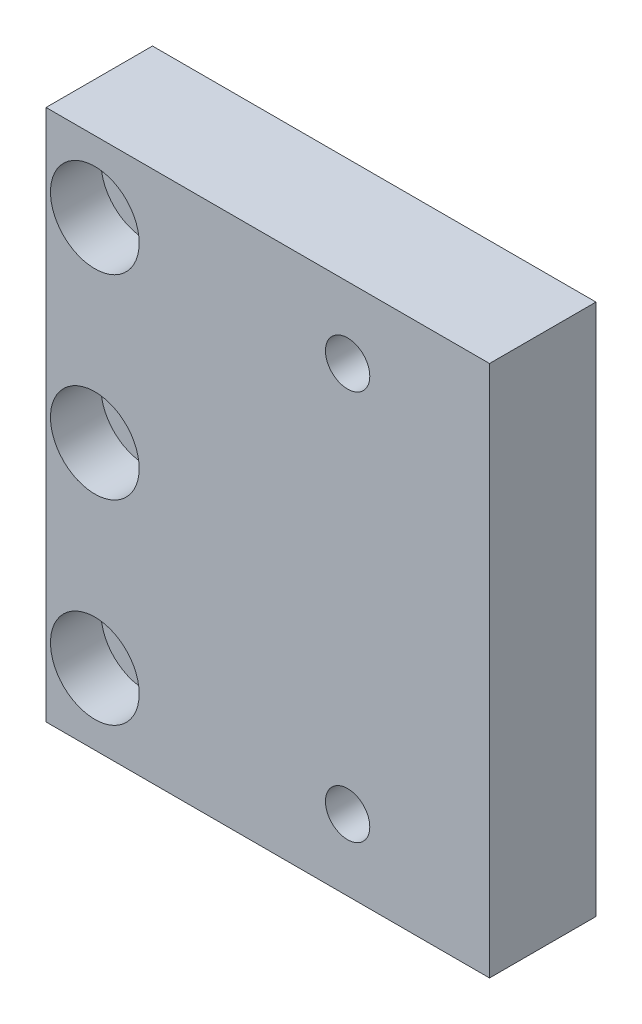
ISO-10303-21;
HEADER;
FILE_DESCRIPTION(('STEP AP214'),'2;1');
FILE_NAME('part.step','',(''),(''),'','','');
FILE_SCHEMA(('AUTOMOTIVE_DESIGN { 1 0 10303 214 1 1 1 1 }'));
ENDSEC;
DATA;
#1=APPLICATION_CONTEXT('core data for automotive mechanical design processes');
#2=APPLICATION_PROTOCOL_DEFINITION('international standard','automotive_design',2000,#1);
#3=PRODUCT_CONTEXT('',#1,'mechanical');
#4=PRODUCT('Part','Part','',(#3));
#5=PRODUCT_RELATED_PRODUCT_CATEGORY('part','',(#4));
#6=PRODUCT_DEFINITION_FORMATION('','',#4);
#7=PRODUCT_DEFINITION_CONTEXT('part definition',#1,'design');
#8=PRODUCT_DEFINITION('design','',#6,#7);
#9=PRODUCT_DEFINITION_SHAPE('','',#8);
#10=(LENGTH_UNIT() NAMED_UNIT(*) SI_UNIT(.MILLI.,.METRE.));
#11=(NAMED_UNIT(*) PLANE_ANGLE_UNIT() SI_UNIT($,.RADIAN.));
#12=(NAMED_UNIT(*) SI_UNIT($,.STERADIAN.) SOLID_ANGLE_UNIT());
#13=UNCERTAINTY_MEASURE_WITH_UNIT(LENGTH_MEASURE(1.E-05),#10,'distance_accuracy_value','');
#14=(GEOMETRIC_REPRESENTATION_CONTEXT(3) GLOBAL_UNCERTAINTY_ASSIGNED_CONTEXT((#13)) GLOBAL_UNIT_ASSIGNED_CONTEXT((#10,
#11,#12)) REPRESENTATION_CONTEXT('',''));
#15=CARTESIAN_POINT('',(0.,0.,0.));
#16=DIRECTION('',(0.,0.,1.));
#17=DIRECTION('',(1.,0.,0.));
#18=AXIS2_PLACEMENT_3D('',#15,#16,#17);
#19=CARTESIAN_POINT('',(1.99999999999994,272.625283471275,12.));
#20=DIRECTION('',(1.,0.,0.));
#21=DIRECTION('',(0.,0.,-1.));
#22=AXIS2_PLACEMENT_3D('',#19,#20,#21);
#23=PLANE('',#22);
#24=DIRECTION('',(0.,-1.,0.));
#25=VECTOR('',#24,1.);
#26=CARTESIAN_POINT('',(1.99999999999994,272.625283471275,0.));
#27=LINE('',#26,#25);
#28=CARTESIAN_POINT('',(1.99999999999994,332.625283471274,0.));
#29=VERTEX_POINT('',#28);
#30=CARTESIAN_POINT('',(1.99999999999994,272.625283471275,0.));
#31=VERTEX_POINT('',#30);
#32=EDGE_CURVE('E79',#29,#31,#27,.T.);
#33=ORIENTED_EDGE('',*,*,#32,.T.);
#34=DIRECTION('',(0.,0.,-1.));
#35=VECTOR('',#34,1.);
#36=CARTESIAN_POINT('',(1.99999999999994,272.625283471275,12.));
#37=LINE('',#36,#35);
#38=CARTESIAN_POINT('',(1.99999999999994,272.625283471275,12.));
#39=VERTEX_POINT('',#38);
#40=EDGE_CURVE('E11',#39,#31,#37,.T.);
#41=ORIENTED_EDGE('',*,*,#40,.F.);
#42=DIRECTION('',(0.,-1.,0.));
#43=VECTOR('',#42,1.);
#44=CARTESIAN_POINT('',(1.99999999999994,272.625283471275,12.));
#45=LINE('',#44,#43);
#46=CARTESIAN_POINT('',(1.99999999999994,332.625283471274,12.));
#47=VERTEX_POINT('',#46);
#48=EDGE_CURVE('E67',#47,#39,#45,.T.);
#49=ORIENTED_EDGE('',*,*,#48,.F.);
#50=DIRECTION('',(0.,0.,-1.));
#51=VECTOR('',#50,1.);
#52=CARTESIAN_POINT('',(1.99999999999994,332.625283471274,12.));
#53=LINE('',#52,#51);
#54=EDGE_CURVE('E75',#47,#29,#53,.T.);
#55=ORIENTED_EDGE('',*,*,#54,.T.);
#56=EDGE_LOOP('',(#33,#41,#49,#55));
#57=FACE_BOUND('',#56,.T.);
#58=ADVANCED_FACE('F16',(#57),#23,.F.);
#59=CARTESIAN_POINT('',(1.99999999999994,272.625283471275,12.));
#60=DIRECTION('',(0.,1.,0.));
#61=DIRECTION('',(0.,0.,1.));
#62=AXIS2_PLACEMENT_3D('',#59,#60,#61);
#63=PLANE('',#62);
#64=DIRECTION('',(1.,0.,0.));
#65=VECTOR('',#64,1.);
#66=CARTESIAN_POINT('',(1.99999999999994,272.625283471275,0.));
#67=LINE('',#66,#65);
#68=CARTESIAN_POINT('',(52.,272.625283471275,0.));
#69=VERTEX_POINT('',#68);
#70=EDGE_CURVE('E71',#31,#69,#67,.T.);
#71=ORIENTED_EDGE('',*,*,#70,.T.);
#72=DIRECTION('',(0.,0.,-1.));
#73=VECTOR('',#72,1.);
#74=CARTESIAN_POINT('',(52.,272.625283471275,12.));
#75=LINE('',#74,#73);
#76=CARTESIAN_POINT('',(52.,272.625283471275,12.));
#77=VERTEX_POINT('',#76);
#78=EDGE_CURVE('E24',#77,#69,#75,.T.);
#79=ORIENTED_EDGE('',*,*,#78,.F.);
#80=DIRECTION('',(1.,0.,0.));
#81=VECTOR('',#80,1.);
#82=CARTESIAN_POINT('',(1.99999999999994,272.625283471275,12.));
#83=LINE('',#82,#81);
#84=EDGE_CURVE('E62',#39,#77,#83,.T.);
#85=ORIENTED_EDGE('',*,*,#84,.F.);
#86=ORIENTED_EDGE('',*,*,#40,.T.);
#87=EDGE_LOOP('',(#71,#79,#85,#86));
#88=FACE_BOUND('',#87,.T.);
#89=ADVANCED_FACE('F70',(#88),#63,.F.);
#90=CARTESIAN_POINT('',(52.,272.625283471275,12.));
#91=DIRECTION('',(-1.,0.,0.));
#92=DIRECTION('',(0.,0.,1.));
#93=AXIS2_PLACEMENT_3D('',#90,#91,#92);
#94=PLANE('',#93);
#95=DIRECTION('',(0.,1.,0.));
#96=VECTOR('',#95,1.);
#97=CARTESIAN_POINT('',(52.,272.625283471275,0.));
#98=LINE('',#97,#96);
#99=CARTESIAN_POINT('',(52.,332.625283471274,0.));
#100=VERTEX_POINT('',#99);
#101=EDGE_CURVE('E49',#69,#100,#98,.T.);
#102=ORIENTED_EDGE('',*,*,#101,.T.);
#103=DIRECTION('',(0.,0.,-1.));
#104=VECTOR('',#103,1.);
#105=CARTESIAN_POINT('',(52.,332.625283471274,12.));
#106=LINE('',#105,#104);
#107=CARTESIAN_POINT('',(52.,332.625283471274,12.));
#108=VERTEX_POINT('',#107);
#109=EDGE_CURVE('E72',#108,#100,#106,.T.);
#110=ORIENTED_EDGE('',*,*,#109,.F.);
#111=DIRECTION('',(0.,1.,0.));
#112=VECTOR('',#111,1.);
#113=CARTESIAN_POINT('',(52.,272.625283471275,12.));
#114=LINE('',#113,#112);
#115=EDGE_CURVE('E65',#77,#108,#114,.T.);
#116=ORIENTED_EDGE('',*,*,#115,.F.);
#117=ORIENTED_EDGE('',*,*,#78,.T.);
#118=EDGE_LOOP('',(#102,#110,#116,#117));
#119=FACE_BOUND('',#118,.T.);
#120=ADVANCED_FACE('F73',(#119),#94,.F.);
#121=CARTESIAN_POINT('',(1.99999999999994,332.625283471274,12.));
#122=DIRECTION('',(0.,-1.,0.));
#123=DIRECTION('',(0.,0.,-1.));
#124=AXIS2_PLACEMENT_3D('',#121,#122,#123);
#125=PLANE('',#124);
#126=DIRECTION('',(-1.,0.,0.));
#127=VECTOR('',#126,1.);
#128=CARTESIAN_POINT('',(1.99999999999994,332.625283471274,0.));
#129=LINE('',#128,#127);
#130=EDGE_CURVE('E55',#100,#29,#129,.T.);
#131=ORIENTED_EDGE('',*,*,#130,.T.);
#132=ORIENTED_EDGE('',*,*,#54,.F.);
#133=DIRECTION('',(-1.,0.,0.));
#134=VECTOR('',#133,1.);
#135=CARTESIAN_POINT('',(1.99999999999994,332.625283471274,12.));
#136=LINE('',#135,#134);
#137=EDGE_CURVE('E32',#108,#47,#136,.T.);
#138=ORIENTED_EDGE('',*,*,#137,.F.);
#139=ORIENTED_EDGE('',*,*,#109,.T.);
#140=EDGE_LOOP('',(#131,#132,#138,#139));
#141=FACE_BOUND('',#140,.T.);
#142=ADVANCED_FACE('F87',(#141),#125,.F.);
#143=CARTESIAN_POINT('',(0.,0.,12.));
#144=DIRECTION('',(0.,0.,-1.));
#145=DIRECTION('',(-1.,0.,0.));
#146=AXIS2_PLACEMENT_3D('',#143,#144,#145);
#147=PLANE('',#146);
#148=CARTESIAN_POINT('',(35.9999998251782,324.625283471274,12.));
#149=DIRECTION('',(0.,0.,1.));
#150=DIRECTION('',(1.,0.,0.));
#151=AXIS2_PLACEMENT_3D('',#148,#149,#150);
#152=CIRCLE('',#151,2.5);
#153=CARTESIAN_POINT('',(38.4999998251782,324.625283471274,12.));
#154=VERTEX_POINT('',#153);
#155=EDGE_CURVE('E137',#154,#154,#152,.T.);
#156=ORIENTED_EDGE('',*,*,#155,.F.);
#157=EDGE_LOOP('',(#156));
#158=FACE_BOUND('',#157,.T.);
#159=CARTESIAN_POINT('',(35.9999998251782,280.625283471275,12.));
#160=DIRECTION('',(0.,0.,1.));
#161=DIRECTION('',(1.,0.,0.));
#162=AXIS2_PLACEMENT_3D('',#159,#160,#161);
#163=CIRCLE('',#162,2.5);
#164=CARTESIAN_POINT('',(38.4999998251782,280.625283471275,12.));
#165=VERTEX_POINT('',#164);
#166=EDGE_CURVE('E131',#165,#165,#163,.T.);
#167=ORIENTED_EDGE('',*,*,#166,.F.);
#168=EDGE_LOOP('',(#167));
#169=FACE_BOUND('',#168,.T.);
#170=CARTESIAN_POINT('',(7.5,280.625283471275,12.));
#171=DIRECTION('',(0.,0.,1.));
#172=DIRECTION('',(1.,0.,0.));
#173=AXIS2_PLACEMENT_3D('',#170,#171,#172);
#174=CIRCLE('',#173,5.);
#175=CARTESIAN_POINT('',(12.5,280.625283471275,12.));
#176=VERTEX_POINT('',#175);
#177=EDGE_CURVE('E125',#176,#176,#174,.T.);
#178=ORIENTED_EDGE('',*,*,#177,.F.);
#179=EDGE_LOOP('',(#178));
#180=FACE_BOUND('',#179,.T.);
#181=CARTESIAN_POINT('',(7.5,302.625283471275,12.));
#182=DIRECTION('',(0.,0.,1.));
#183=DIRECTION('',(1.,0.,0.));
#184=AXIS2_PLACEMENT_3D('',#181,#182,#183);
#185=CIRCLE('',#184,5.);
#186=CARTESIAN_POINT('',(12.5,302.625283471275,12.));
#187=VERTEX_POINT('',#186);
#188=EDGE_CURVE('E113',#187,#187,#185,.T.);
#189=ORIENTED_EDGE('',*,*,#188,.F.);
#190=EDGE_LOOP('',(#189));
#191=FACE_BOUND('',#190,.T.);
#192=CARTESIAN_POINT('',(7.5,324.625283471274,12.));
#193=DIRECTION('',(0.,0.,1.));
#194=DIRECTION('',(1.,0.,0.));
#195=AXIS2_PLACEMENT_3D('',#192,#193,#194);
#196=CIRCLE('',#195,5.);
#197=CARTESIAN_POINT('',(12.5,324.625283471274,12.));
#198=VERTEX_POINT('',#197);
#199=EDGE_CURVE('E101',#198,#198,#196,.T.);
#200=ORIENTED_EDGE('',*,*,#199,.F.);
#201=EDGE_LOOP('',(#200));
#202=FACE_BOUND('',#201,.T.);
#203=ORIENTED_EDGE('',*,*,#48,.T.);
#204=ORIENTED_EDGE('',*,*,#84,.T.);
#205=ORIENTED_EDGE('',*,*,#115,.T.);
#206=ORIENTED_EDGE('',*,*,#137,.T.);
#207=EDGE_LOOP('',(#203,#204,#205,#206));
#208=FACE_BOUND('',#207,.T.);
#209=ADVANCED_FACE('F63',(#158,#169,#180,#191,#202,#208),#147,.F.);
#210=CARTESIAN_POINT('',(0.,0.,0.));
#211=DIRECTION('',(0.,0.,-1.));
#212=DIRECTION('',(-1.,0.,0.));
#213=AXIS2_PLACEMENT_3D('',#210,#211,#212);
#214=PLANE('',#213);
#215=CARTESIAN_POINT('',(35.9999998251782,324.625283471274,0.));
#216=DIRECTION('',(0.,0.,1.));
#217=DIRECTION('',(1.,0.,0.));
#218=AXIS2_PLACEMENT_3D('',#215,#216,#217);
#219=CIRCLE('',#218,2.5);
#220=CARTESIAN_POINT('',(38.4999998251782,324.625283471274,0.));
#221=VERTEX_POINT('',#220);
#222=EDGE_CURVE('E134',#221,#221,#219,.T.);
#223=ORIENTED_EDGE('',*,*,#222,.T.);
#224=EDGE_LOOP('',(#223));
#225=FACE_BOUND('',#224,.T.);
#226=CARTESIAN_POINT('',(35.9999998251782,280.625283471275,0.));
#227=DIRECTION('',(0.,0.,1.));
#228=DIRECTION('',(1.,0.,0.));
#229=AXIS2_PLACEMENT_3D('',#226,#227,#228);
#230=CIRCLE('',#229,2.5);
#231=CARTESIAN_POINT('',(38.4999998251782,280.625283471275,0.));
#232=VERTEX_POINT('',#231);
#233=EDGE_CURVE('E128',#232,#232,#230,.T.);
#234=ORIENTED_EDGE('',*,*,#233,.T.);
#235=EDGE_LOOP('',(#234));
#236=FACE_BOUND('',#235,.T.);
#237=CARTESIAN_POINT('',(7.5,280.625283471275,0.));
#238=DIRECTION('',(0.,0.,1.));
#239=DIRECTION('',(1.,0.,0.));
#240=AXIS2_PLACEMENT_3D('',#237,#238,#239);
#241=CIRCLE('',#240,2.75);
#242=CARTESIAN_POINT('',(10.25,280.625283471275,0.));
#243=VERTEX_POINT('',#242);
#244=EDGE_CURVE('E116',#243,#243,#241,.T.);
#245=ORIENTED_EDGE('',*,*,#244,.T.);
#246=EDGE_LOOP('',(#245));
#247=FACE_BOUND('',#246,.T.);
#248=CARTESIAN_POINT('',(7.5,302.625283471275,0.));
#249=DIRECTION('',(0.,0.,1.));
#250=DIRECTION('',(1.,0.,0.));
#251=AXIS2_PLACEMENT_3D('',#248,#249,#250);
#252=CIRCLE('',#251,2.75);
#253=CARTESIAN_POINT('',(10.25,302.625283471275,0.));
#254=VERTEX_POINT('',#253);
#255=EDGE_CURVE('E104',#254,#254,#252,.T.);
#256=ORIENTED_EDGE('',*,*,#255,.T.);
#257=EDGE_LOOP('',(#256));
#258=FACE_BOUND('',#257,.T.);
#259=CARTESIAN_POINT('',(7.5,324.625283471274,0.));
#260=DIRECTION('',(0.,0.,1.));
#261=DIRECTION('',(1.,0.,0.));
#262=AXIS2_PLACEMENT_3D('',#259,#260,#261);
#263=CIRCLE('',#262,2.75);
#264=CARTESIAN_POINT('',(10.25,324.625283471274,0.));
#265=VERTEX_POINT('',#264);
#266=EDGE_CURVE('E82',#265,#265,#263,.T.);
#267=ORIENTED_EDGE('',*,*,#266,.T.);
#268=EDGE_LOOP('',(#267));
#269=FACE_BOUND('',#268,.T.);
#270=ORIENTED_EDGE('',*,*,#32,.F.);
#271=ORIENTED_EDGE('',*,*,#130,.F.);
#272=ORIENTED_EDGE('',*,*,#101,.F.);
#273=ORIENTED_EDGE('',*,*,#70,.F.);
#274=EDGE_LOOP('',(#270,#271,#272,#273));
#275=FACE_BOUND('',#274,.T.);
#276=ADVANCED_FACE('F90',(#225,#236,#247,#258,#269,#275),#214,.T.);
#277=CARTESIAN_POINT('',(7.5,324.625283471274,12.));
#278=DIRECTION('',(0.,0.,1.));
#279=DIRECTION('',(1.,0.,0.));
#280=AXIS2_PLACEMENT_3D('',#277,#278,#279);
#281=CYLINDRICAL_SURFACE('',#280,2.75);
#282=ORIENTED_EDGE('',*,*,#266,.F.);
#283=EDGE_LOOP('',(#282));
#284=FACE_BOUND('',#283,.T.);
#285=CARTESIAN_POINT('',(7.5,324.625283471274,6.3));
#286=DIRECTION('',(0.,0.,1.));
#287=DIRECTION('',(1.,0.,0.));
#288=AXIS2_PLACEMENT_3D('',#285,#286,#287);
#289=CIRCLE('',#288,2.75);
#290=CARTESIAN_POINT('',(10.25,324.625283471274,6.3));
#291=VERTEX_POINT('',#290);
#292=EDGE_CURVE('E95',#291,#291,#289,.T.);
#293=ORIENTED_EDGE('',*,*,#292,.T.);
#294=EDGE_LOOP('',(#293));
#295=FACE_BOUND('',#294,.T.);
#296=ADVANCED_FACE('F169',(#284,#295),#281,.F.);
#297=CARTESIAN_POINT('',(10.25,324.625283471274,6.3));
#298=DIRECTION('',(0.,0.,-1.));
#299=DIRECTION('',(-1.,0.,0.));
#300=AXIS2_PLACEMENT_3D('',#297,#298,#299);
#301=PLANE('',#300);
#302=ORIENTED_EDGE('',*,*,#292,.F.);
#303=EDGE_LOOP('',(#302));
#304=FACE_BOUND('',#303,.T.);
#305=CARTESIAN_POINT('',(7.5,324.625283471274,6.3));
#306=DIRECTION('',(0.,0.,1.));
#307=DIRECTION('',(1.,0.,0.));
#308=AXIS2_PLACEMENT_3D('',#305,#306,#307);
#309=CIRCLE('',#308,5.);
#310=CARTESIAN_POINT('',(12.5,324.625283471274,6.3));
#311=VERTEX_POINT('',#310);
#312=EDGE_CURVE('E98',#311,#311,#309,.T.);
#313=ORIENTED_EDGE('',*,*,#312,.T.);
#314=EDGE_LOOP('',(#313));
#315=FACE_BOUND('',#314,.T.);
#316=ADVANCED_FACE('F157',(#304,#315),#301,.F.);
#317=CARTESIAN_POINT('',(7.5,324.625283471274,12.));
#318=DIRECTION('',(0.,0.,1.));
#319=DIRECTION('',(1.,0.,0.));
#320=AXIS2_PLACEMENT_3D('',#317,#318,#319);
#321=CYLINDRICAL_SURFACE('',#320,5.);
#322=ORIENTED_EDGE('',*,*,#312,.F.);
#323=EDGE_LOOP('',(#322));
#324=FACE_BOUND('',#323,.T.);
#325=ORIENTED_EDGE('',*,*,#199,.T.);
#326=EDGE_LOOP('',(#325));
#327=FACE_BOUND('',#326,.T.);
#328=ADVANCED_FACE('F154',(#324,#327),#321,.F.);
#329=CARTESIAN_POINT('',(7.5,302.625283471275,12.));
#330=DIRECTION('',(0.,0.,1.));
#331=DIRECTION('',(1.,0.,0.));
#332=AXIS2_PLACEMENT_3D('',#329,#330,#331);
#333=CYLINDRICAL_SURFACE('',#332,2.75);
#334=ORIENTED_EDGE('',*,*,#255,.F.);
#335=EDGE_LOOP('',(#334));
#336=FACE_BOUND('',#335,.T.);
#337=CARTESIAN_POINT('',(7.5,302.625283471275,6.3));
#338=DIRECTION('',(0.,0.,1.));
#339=DIRECTION('',(1.,0.,0.));
#340=AXIS2_PLACEMENT_3D('',#337,#338,#339);
#341=CIRCLE('',#340,2.75);
#342=CARTESIAN_POINT('',(10.25,302.625283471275,6.3));
#343=VERTEX_POINT('',#342);
#344=EDGE_CURVE('E107',#343,#343,#341,.T.);
#345=ORIENTED_EDGE('',*,*,#344,.T.);
#346=EDGE_LOOP('',(#345));
#347=FACE_BOUND('',#346,.T.);
#348=ADVANCED_FACE('F156',(#336,#347),#333,.F.);
#349=CARTESIAN_POINT('',(10.25,302.625283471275,6.3));
#350=DIRECTION('',(0.,0.,-1.));
#351=DIRECTION('',(-1.,0.,0.));
#352=AXIS2_PLACEMENT_3D('',#349,#350,#351);
#353=PLANE('',#352);
#354=ORIENTED_EDGE('',*,*,#344,.F.);
#355=EDGE_LOOP('',(#354));
#356=FACE_BOUND('',#355,.T.);
#357=CARTESIAN_POINT('',(7.5,302.625283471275,6.3));
#358=DIRECTION('',(0.,0.,1.));
#359=DIRECTION('',(1.,0.,0.));
#360=AXIS2_PLACEMENT_3D('',#357,#358,#359);
#361=CIRCLE('',#360,5.);
#362=CARTESIAN_POINT('',(12.5,302.625283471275,6.3));
#363=VERTEX_POINT('',#362);
#364=EDGE_CURVE('E110',#363,#363,#361,.T.);
#365=ORIENTED_EDGE('',*,*,#364,.T.);
#366=EDGE_LOOP('',(#365));
#367=FACE_BOUND('',#366,.T.);
#368=ADVANCED_FACE('F166',(#356,#367),#353,.F.);
#369=CARTESIAN_POINT('',(7.5,302.625283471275,12.));
#370=DIRECTION('',(0.,0.,1.));
#371=DIRECTION('',(1.,0.,0.));
#372=AXIS2_PLACEMENT_3D('',#369,#370,#371);
#373=CYLINDRICAL_SURFACE('',#372,5.);
#374=ORIENTED_EDGE('',*,*,#364,.F.);
#375=EDGE_LOOP('',(#374));
#376=FACE_BOUND('',#375,.T.);
#377=ORIENTED_EDGE('',*,*,#188,.T.);
#378=EDGE_LOOP('',(#377));
#379=FACE_BOUND('',#378,.T.);
#380=ADVANCED_FACE('F231',(#376,#379),#373,.F.);
#381=CARTESIAN_POINT('',(7.5,280.625283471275,12.));
#382=DIRECTION('',(0.,0.,1.));
#383=DIRECTION('',(1.,0.,0.));
#384=AXIS2_PLACEMENT_3D('',#381,#382,#383);
#385=CYLINDRICAL_SURFACE('',#384,2.75);
#386=ORIENTED_EDGE('',*,*,#244,.F.);
#387=EDGE_LOOP('',(#386));
#388=FACE_BOUND('',#387,.T.);
#389=CARTESIAN_POINT('',(7.5,280.625283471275,6.3));
#390=DIRECTION('',(0.,0.,1.));
#391=DIRECTION('',(1.,0.,0.));
#392=AXIS2_PLACEMENT_3D('',#389,#390,#391);
#393=CIRCLE('',#392,2.75);
#394=CARTESIAN_POINT('',(10.25,280.625283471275,6.3));
#395=VERTEX_POINT('',#394);
#396=EDGE_CURVE('E119',#395,#395,#393,.T.);
#397=ORIENTED_EDGE('',*,*,#396,.T.);
#398=EDGE_LOOP('',(#397));
#399=FACE_BOUND('',#398,.T.);
#400=ADVANCED_FACE('F241',(#388,#399),#385,.F.);
#401=CARTESIAN_POINT('',(10.25,280.625283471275,6.3));
#402=DIRECTION('',(0.,0.,-1.));
#403=DIRECTION('',(-1.,0.,0.));
#404=AXIS2_PLACEMENT_3D('',#401,#402,#403);
#405=PLANE('',#404);
#406=ORIENTED_EDGE('',*,*,#396,.F.);
#407=EDGE_LOOP('',(#406));
#408=FACE_BOUND('',#407,.T.);
#409=CARTESIAN_POINT('',(7.5,280.625283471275,6.3));
#410=DIRECTION('',(0.,0.,1.));
#411=DIRECTION('',(1.,0.,0.));
#412=AXIS2_PLACEMENT_3D('',#409,#410,#411);
#413=CIRCLE('',#412,5.);
#414=CARTESIAN_POINT('',(12.5,280.625283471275,6.3));
#415=VERTEX_POINT('',#414);
#416=EDGE_CURVE('E122',#415,#415,#413,.T.);
#417=ORIENTED_EDGE('',*,*,#416,.T.);
#418=EDGE_LOOP('',(#417));
#419=FACE_BOUND('',#418,.T.);
#420=ADVANCED_FACE('F251',(#408,#419),#405,.F.);
#421=CARTESIAN_POINT('',(7.5,280.625283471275,12.));
#422=DIRECTION('',(0.,0.,1.));
#423=DIRECTION('',(1.,0.,0.));
#424=AXIS2_PLACEMENT_3D('',#421,#422,#423);
#425=CYLINDRICAL_SURFACE('',#424,5.);
#426=ORIENTED_EDGE('',*,*,#416,.F.);
#427=EDGE_LOOP('',(#426));
#428=FACE_BOUND('',#427,.T.);
#429=ORIENTED_EDGE('',*,*,#177,.T.);
#430=EDGE_LOOP('',(#429));
#431=FACE_BOUND('',#430,.T.);
#432=ADVANCED_FACE('F261',(#428,#431),#425,.F.);
#433=CARTESIAN_POINT('',(35.9999998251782,280.625283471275,12.));
#434=DIRECTION('',(0.,0.,1.));
#435=DIRECTION('',(1.,0.,0.));
#436=AXIS2_PLACEMENT_3D('',#433,#434,#435);
#437=CYLINDRICAL_SURFACE('',#436,2.5);
#438=ORIENTED_EDGE('',*,*,#233,.F.);
#439=EDGE_LOOP('',(#438));
#440=FACE_BOUND('',#439,.T.);
#441=ORIENTED_EDGE('',*,*,#166,.T.);
#442=EDGE_LOOP('',(#441));
#443=FACE_BOUND('',#442,.T.);
#444=ADVANCED_FACE('F271',(#440,#443),#437,.F.);
#445=CARTESIAN_POINT('',(35.9999998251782,324.625283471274,12.));
#446=DIRECTION('',(0.,0.,1.));
#447=DIRECTION('',(1.,0.,0.));
#448=AXIS2_PLACEMENT_3D('',#445,#446,#447);
#449=CYLINDRICAL_SURFACE('',#448,2.5);
#450=ORIENTED_EDGE('',*,*,#222,.F.);
#451=EDGE_LOOP('',(#450));
#452=FACE_BOUND('',#451,.T.);
#453=ORIENTED_EDGE('',*,*,#155,.T.);
#454=EDGE_LOOP('',(#453));
#455=FACE_BOUND('',#454,.T.);
#456=ADVANCED_FACE('F141',(#452,#455),#449,.F.);
#457=CLOSED_SHELL('',(#58,#89,#120,#142,#209,#276,#296,#316,#328,#348,#368,#380,#400,#420,#432,
#444,#456));
#458=MANIFOLD_SOLID_BREP('B1',#457);
#459=ADVANCED_BREP_SHAPE_REPRESENTATION('',(#18,#458),#14);
#460=SHAPE_DEFINITION_REPRESENTATION(#9,#459);
ENDSEC;
END-ISO-10303-21;
